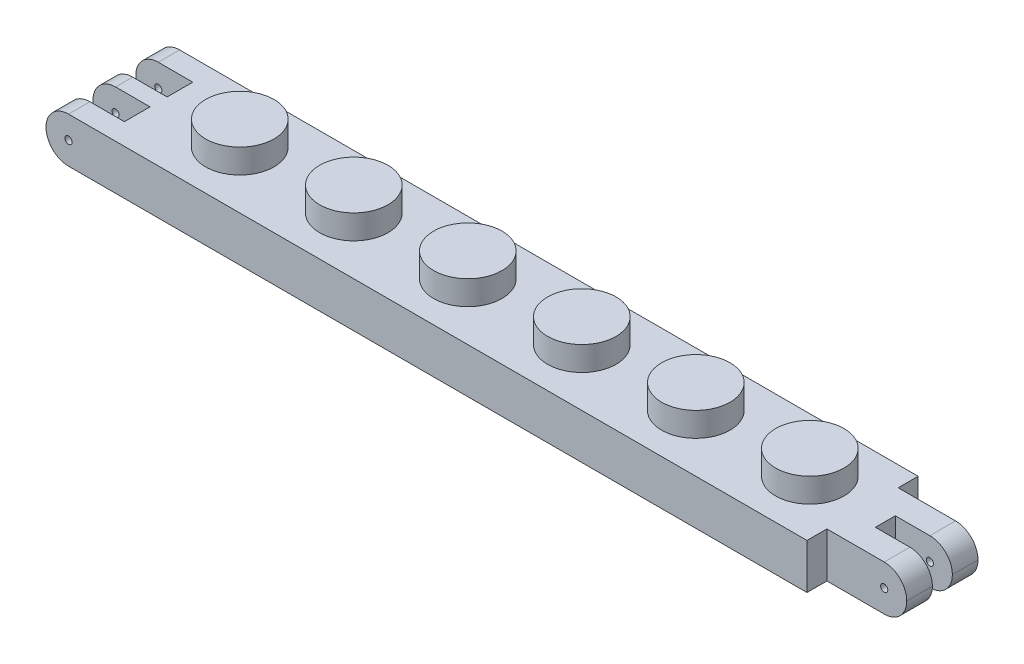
from build123d import *

# Parameters (mm, degrees)
SKETCH1_W           = 47.8
SKETCH1_H           = 7.8
EXTRUDE1_DEPTH      = 3.166
SKETCH2_R           = 2.4
EXTRUDE2_DEPTH      = 1.7
SKETCH3_W           = 4.8
SKETCH3_H           = 4.8
EXTRUDE3_DEPTH      = 1.8
LPATTERN1_COUNT     = 6
LPATTERN1_PITCH     = 8
LPATTERN2_COUNT     = 6
LPATTERN2_PITCH     = 8
SKETCH5_W           = 5
SKETCH5_H           = 3.166
BOSS_EXTRUDE1_DEPTH = 5.6
SKETCH6_W           = 1.4
SKETCH6_H           = 3.166
CUT_EXTRUDE1_DEPTH  = 4
FILLET1_R           = 1.58
SKETCH7_R           = 0.25
CUT_EXTRUDE2_DEPTH  = 55.001832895
SKETCH8_W           = 7.8
SKETCH8_H           = 3.166
BOSS_EXTRUDE2_DEPTH = 5.6
SKETCH9_W           = 4
SKETCH9_H           = 1.8
CUT_EXTRUDE3_DEPTH  = 55.059444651
FILLET2_R           = 1.58
SKETCH10_R          = 0.25
CUT_EXTRUDE4_DEPTH  = 55.185588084


with BuildPart() as part:
    # Sketch1 → Extrude1 (new body)
    with BuildSketch(Plane(origin=(0, 0, 0), x_dir=(1, 0, 0), z_dir=(0, 1, 0))):
        with Locations((23.9, 3.9)):
            Rectangle(SKETCH1_W, SKETCH1_H)
    extrude(amount=EXTRUDE1_DEPTH)

    # Sketch2 → Extrude2 (add)
    with BuildSketch(Plane(origin=(0, 3.166, 0), x_dir=(1, 0, 0), z_dir=(0, 1, 0))):
        with Locations(Location((4, 4, 0), (0, 0, 90))):
            Circle(SKETCH2_R)
    extrude2 = extrude(amount=EXTRUDE2_DEPTH)

    # Sketch3 → Extrude3 (cut)
    with BuildSketch(Plane.XZ):
        with Locations((43.95, -3.95)):
            Rectangle(SKETCH3_W, SKETCH3_H)
    extrude3 = extrude(amount=-EXTRUDE3_DEPTH, mode=Mode.SUBTRACT)

    # LPattern1: Extrude2 ×6
    with Locations(*[(i * LPATTERN1_PITCH, 0, 0) for i in range(1, LPATTERN1_COUNT)]):
        add(extrude2)

    # LPattern2: Extrude3 ×6
    with Locations(*[(-i * LPATTERN2_PITCH, 0, 0) for i in range(1, LPATTERN2_COUNT)]):
        add(extrude3, mode=Mode.SUBTRACT)

    # Sketch5 → Boss-Extrude1 (add)
    with BuildSketch(Plane(origin=(47.8, 0, 0), x_dir=(0, 0, -1), z_dir=(1, 0, 0))):
        with Locations((3.9, 1.583)):
            Rectangle(SKETCH5_W, SKETCH5_H)
    extrude(amount=BOSS_EXTRUDE1_DEPTH)

    # Sketch6 → Cut-Extrude1 (cut)
    with BuildSketch(Plane(origin=(53.4, 0, 0), x_dir=(0, 0, -1), z_dir=(1, 0, 0))):
        with Locations((3.9, 1.583)):
            Rectangle(SKETCH6_W, SKETCH6_H)
    extrude(amount=-CUT_EXTRUDE1_DEPTH, mode=Mode.SUBTRACT)

    # Fillet1
    fillet1_edges = [part.edges().sort_by_distance(p)[0] for p in [
        (53.4, 0, -5.5),
        (53.4, 3.166, -5.5),
        (53.4, 0, -2.3),
        (53.4, 3.166, -2.3),
    ]]
    fillet(fillet1_edges, radius=FILLET1_R)

    # Sketch7 → Cut-Extrude2 (cut, through all)
    with BuildSketch(Plane.XY.offset(-1.4)):
        with Locations((51.82, 1.58)):
            Circle(SKETCH7_R)
    extrude(amount=-CUT_EXTRUDE2_DEPTH, mode=Mode.SUBTRACT)

    # Sketch8 → Boss-Extrude2 (add)
    with BuildSketch(Plane.ZY):
        with Locations((-3.9, 1.583)):
            Rectangle(SKETCH8_W, SKETCH8_H)
    extrude(amount=BOSS_EXTRUDE2_DEPTH)

    # Sketch9 → Cut-Extrude3 (cut, through all)
    with BuildSketch(Plane(origin=(0, 3.166, 0), x_dir=(1, 0, 0), z_dir=(0, 1, 0))):
        with Locations((-3.6, 5.4)):
            Rectangle(SKETCH9_W, SKETCH9_H)
        with Locations((-3.6, 2.4)):
            Rectangle(SKETCH9_W, SKETCH9_H)
    extrude(amount=-CUT_EXTRUDE3_DEPTH, mode=Mode.SUBTRACT)

    # Fillet2
    fillet2_edges = [part.edges().sort_by_distance(p)[0] for p in [
        (-5.6, 0, -7.05),
        (-5.6, 3.166, -0.75),
        (-5.6, 0, -3.9),
        (-5.6, 3.166, -7.05),
        (-5.6, 0, -0.75),
        (-5.6, 3.166, -3.9),
    ]]
    fillet(fillet2_edges, radius=FILLET2_R)

    # Sketch10 → Cut-Extrude4 (cut, through all)
    with BuildSketch(Plane(origin=(0, 0, -7.8), x_dir=(-1, 0, 0), z_dir=(0, 0, -1))):
        with Locations((4.02, 1.58)):
            Circle(SKETCH10_R)
    extrude(amount=-CUT_EXTRUDE4_DEPTH, mode=Mode.SUBTRACT)


solid = part.part
